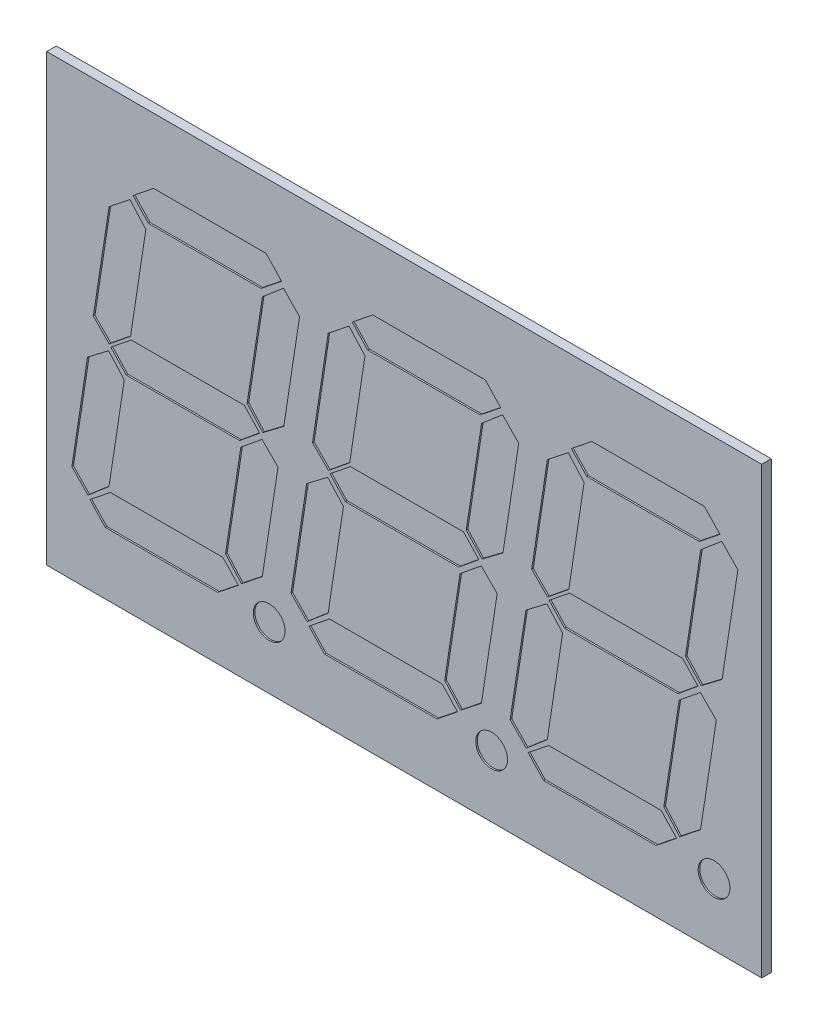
from build123d import *

# Parameters (mm, degrees)
SKETCH1_W           = 22.5
SKETCH1_H           = 14
BOSS_EXTRUDE1_DEPTH = 0.15
CUT_EXTRUDE1_START  = 0.15
SKETCH4_R           = 0.5
CUT_EXTRUDE1_DEPTH  = 0.05


with BuildPart() as part:
    # Sketch1 → Boss-Extrude1 (new, symmetric)
    with BuildSketch(Plane.XY):
        with Locations((-11.25, -7)):
            Rectangle(SKETCH1_W, SKETCH1_H)
    extrude(amount=BOSS_EXTRUDE1_DEPTH, both=True)

    # Sketch4 → Cut-Extrude1 (cut)
    with BuildSketch(Plane.XY.offset(CUT_EXTRUDE1_START)):
        with Locations(Location((-15.5, -12.050132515, 0), (0, 0, 180))):
            Circle(SKETCH4_R)
        with Locations(Location((-8.5, -12.050132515, 0), (0, 0, 180))):
            Circle(SKETCH4_R)
        with Locations(Location((-1.5, -12.050132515, 0), (0, 0, 180))):
            Circle(SKETCH4_R)
        Polygon((-19.863505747, -6.444888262), (-20.531609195, -6.985477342), (-21.032686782, -6.480807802), (-20.538793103, -3.248049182), (-19.883261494, -2.727215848), (-19.382183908, -3.287560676), align=None)
        Polygon((-20.54058908, -10.877359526), (-21.203304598, -11.441296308), (-21.709770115, -10.920462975), (-21.215876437, -7.685908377), (-20.554956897, -7.183034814), (-20.059267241, -7.729011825), align=None)
        Polygon((-16.470905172, -11.532891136), (-17.117456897, -12.050132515), (-20.659123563, -12.050132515), (-21.144037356, -11.532891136), (-20.497485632, -11.015649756), (-16.955818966, -11.015649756), align=None)
        Polygon((-15.716594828, -10.920462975), (-16.372126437, -11.441296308), (-16.873204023, -10.879155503), (-16.391882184, -7.727215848), (-15.723778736, -7.183034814), (-15.222701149, -7.687704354), align=None)
        Polygon((-15.039511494, -6.486195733), (-15.698635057, -6.985477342), (-16.194324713, -6.441296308), (-15.713002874, -3.289356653), (-15.050287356, -2.727215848), (-14.543821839, -3.249845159), align=None)
        Polygon((-15.109554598, -2.567373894), (-15.756106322, -3.084615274), (-19.299568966, -3.084615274), (-19.784482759, -2.567373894), (-19.137931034, -2.050132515), (-15.594468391, -2.050132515), align=None)
        Polygon((-15.797413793, -7.050132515), (-16.429597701, -7.567373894), (-20, -7.567373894), (-20.484913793, -7.050132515), (-19.838362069, -6.532891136), (-16.282327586, -6.532891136), align=None)
        Polygon((-12.966954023, -6.444888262), (-13.635057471, -6.985477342), (-14.136135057, -6.480807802), (-13.642241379, -3.248049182), (-12.98670977, -2.727215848), (-12.485632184, -3.287560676), align=None)
        Polygon((-13.644037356, -10.877359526), (-14.306752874, -11.441296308), (-14.813218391, -10.920462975), (-14.319324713, -7.685908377), (-13.658405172, -7.183034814), (-13.162715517, -7.729011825), align=None)
        Polygon((-9.574353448, -11.532891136), (-10.220905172, -12.050132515), (-13.762571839, -12.050132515), (-14.247485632, -11.532891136), (-13.600933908, -11.015649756), (-10.059267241, -11.015649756), align=None)
        Polygon((-8.820043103, -10.920462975), (-9.475574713, -11.441296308), (-9.976652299, -10.879155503), (-9.49533046, -7.727215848), (-8.827227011, -7.183034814), (-8.326149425, -7.687704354), align=None)
        Polygon((-8.14295977, -6.486195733), (-8.802083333, -6.985477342), (-9.297772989, -6.441296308), (-8.816451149, -3.289356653), (-8.153735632, -2.727215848), (-7.647270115, -3.249845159), align=None)
        Polygon((-8.213002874, -2.567373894), (-8.859554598, -3.084615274), (-12.403017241, -3.084615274), (-12.887931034, -2.567373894), (-12.24137931, -2.050132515), (-8.697916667, -2.050132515), align=None)
        Polygon((-8.900862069, -7.050132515), (-9.533045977, -7.567373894), (-13.103448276, -7.567373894), (-13.588362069, -7.050132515), (-12.941810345, -6.532891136), (-9.385775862, -6.532891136), align=None)
        Polygon((-6.070402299, -6.444888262), (-6.738505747, -6.985477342), (-7.239583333, -6.480807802), (-6.745689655, -3.248049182), (-6.090158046, -2.727215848), (-5.58908046, -3.287560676), align=None)
        Polygon((-6.747485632, -10.877359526), (-7.410201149, -11.441296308), (-7.916666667, -10.920462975), (-7.422772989, -7.685908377), (-6.761853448, -7.183034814), (-6.266163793, -7.729011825), align=None)
        Polygon((-2.677801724, -11.532891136), (-3.324353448, -12.050132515), (-6.866020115, -12.050132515), (-7.350933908, -11.532891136), (-6.704382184, -11.015649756), (-3.162715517, -11.015649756), align=None)
        Polygon((-1.923491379, -10.920462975), (-2.579022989, -11.441296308), (-3.080100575, -10.879155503), (-2.598778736, -7.727215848), (-1.930675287, -7.183034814), (-1.429597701, -7.687704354), align=None)
        Polygon((-1.246408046, -6.486195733), (-1.905531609, -6.985477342), (-2.401221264, -6.441296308), (-1.919899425, -3.289356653), (-1.257183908, -2.727215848), (-0.750718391, -3.249845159), align=None)
        Polygon((-1.316451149, -2.567373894), (-1.963002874, -3.084615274), (-5.506465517, -3.084615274), (-5.99137931, -2.567373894), (-5.344827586, -2.050132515), (-1.801364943, -2.050132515), align=None)
        Polygon((-2.004310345, -7.050132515), (-2.636494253, -7.567373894), (-6.206896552, -7.567373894), (-6.691810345, -7.050132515), (-6.045258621, -6.532891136), (-2.489224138, -6.532891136), align=None)
    extrude(amount=-CUT_EXTRUDE1_DEPTH, mode=Mode.SUBTRACT)


solid = part.part
